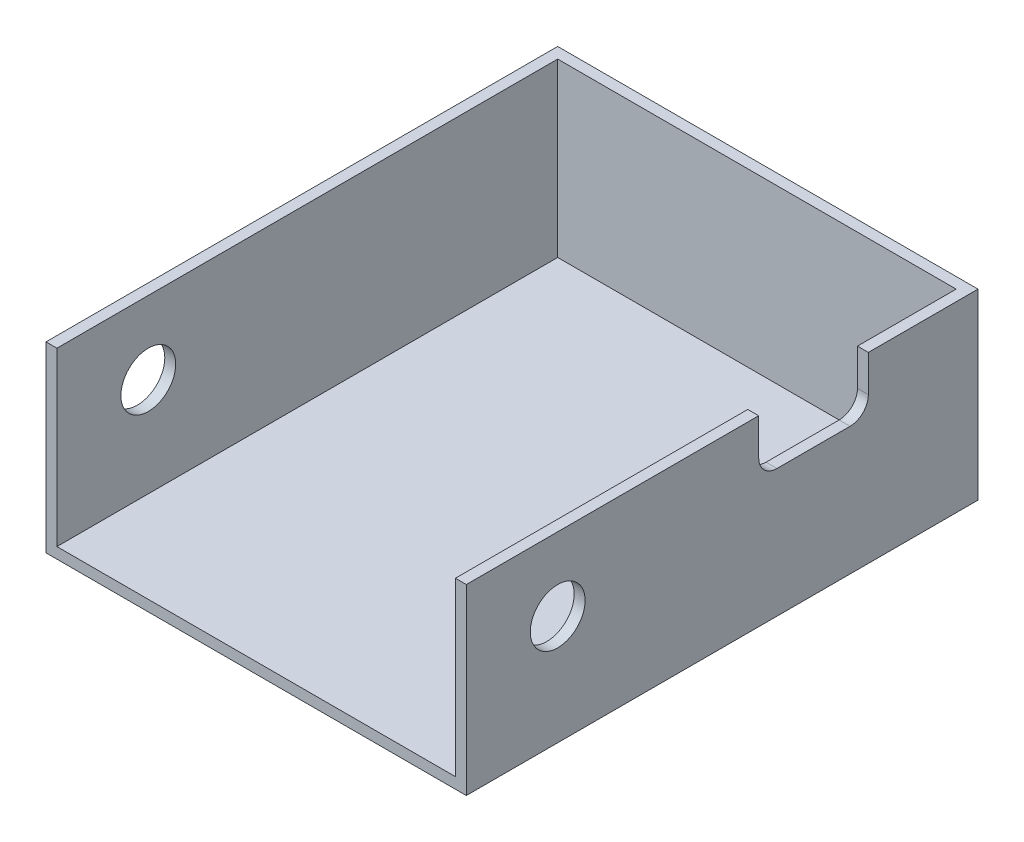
ISO-10303-21;
HEADER;
FILE_DESCRIPTION(('STEP AP214'),'2;1');
FILE_NAME('part.step','',(''),(''),'','','');
FILE_SCHEMA(('AUTOMOTIVE_DESIGN { 1 0 10303 214 1 1 1 1 }'));
ENDSEC;
DATA;
#1=APPLICATION_CONTEXT('core data for automotive mechanical design processes');
#2=APPLICATION_PROTOCOL_DEFINITION('international standard','automotive_design',2000,#1);
#3=PRODUCT_CONTEXT('',#1,'mechanical');
#4=PRODUCT('Part','Part','',(#3));
#5=PRODUCT_RELATED_PRODUCT_CATEGORY('part','',(#4));
#6=PRODUCT_DEFINITION_FORMATION('','',#4);
#7=PRODUCT_DEFINITION_CONTEXT('part definition',#1,'design');
#8=PRODUCT_DEFINITION('design','',#6,#7);
#9=PRODUCT_DEFINITION_SHAPE('','',#8);
#10=(LENGTH_UNIT() NAMED_UNIT(*) SI_UNIT(.MILLI.,.METRE.));
#11=(NAMED_UNIT(*) PLANE_ANGLE_UNIT() SI_UNIT($,.RADIAN.));
#12=(NAMED_UNIT(*) SI_UNIT($,.STERADIAN.) SOLID_ANGLE_UNIT());
#13=UNCERTAINTY_MEASURE_WITH_UNIT(LENGTH_MEASURE(1.E-05),#10,'distance_accuracy_value','');
#14=(GEOMETRIC_REPRESENTATION_CONTEXT(3) GLOBAL_UNCERTAINTY_ASSIGNED_CONTEXT((#13)) GLOBAL_UNIT_ASSIGNED_CONTEXT((#10,
#11,#12)) REPRESENTATION_CONTEXT('',''));
#15=CARTESIAN_POINT('',(0.,0.,0.));
#16=DIRECTION('',(0.,0.,1.));
#17=DIRECTION('',(1.,0.,0.));
#18=AXIS2_PLACEMENT_3D('',#15,#16,#17);
#19=CARTESIAN_POINT('',(71.12762,31.75,38.1));
#20=DIRECTION('',(0.,0.,1.));
#21=DIRECTION('',(0.,-1.,0.));
#22=AXIS2_PLACEMENT_3D('',#19,#20,#21);
#23=PLANE('',#22);
#24=DIRECTION('',(0.,-1.,0.));
#25=VECTOR('',#24,1.);
#26=CARTESIAN_POINT('',(71.12762,16.82369,38.1000000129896));
#27=LINE('',#26,#25);
#28=CARTESIAN_POINT('',(71.12762,31.75,38.1000000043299));
#29=VERTEX_POINT('',#28);
#30=CARTESIAN_POINT('',(71.12762,25.3999999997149,38.1000000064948));
#31=VERTEX_POINT('',#30);
#32=EDGE_CURVE('E114',#29,#31,#27,.T.);
#33=ORIENTED_EDGE('',*,*,#32,.F.);
#34=DIRECTION('',(1.,0.,0.));
#35=VECTOR('',#34,1.);
#36=CARTESIAN_POINT('',(72.07631,31.75,38.1));
#37=LINE('',#36,#35);
#38=CARTESIAN_POINT('',(73.025,31.75,38.1000000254));
#39=VERTEX_POINT('',#38);
#40=EDGE_CURVE('E161',#29,#39,#37,.T.);
#41=ORIENTED_EDGE('',*,*,#40,.T.);
#42=DIRECTION('',(0.,-1.,0.));
#43=VECTOR('',#42,1.);
#44=CARTESIAN_POINT('',(73.025,15.875,38.1000000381));
#45=LINE('',#44,#43);
#46=CARTESIAN_POINT('',(73.025,25.3999999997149,38.10000001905));
#47=VERTEX_POINT('',#46);
#48=EDGE_CURVE('E160',#39,#47,#45,.T.);
#49=ORIENTED_EDGE('',*,*,#48,.T.);
#50=DIRECTION('',(-1.,0.,0.));
#51=VECTOR('',#50,1.);
#52=CARTESIAN_POINT('',(72.07631,25.3999999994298,38.1));
#53=LINE('',#52,#51);
#54=EDGE_CURVE('E133',#31,#47,#53,.F.);
#55=ORIENTED_EDGE('',*,*,#54,.F.);
#56=EDGE_LOOP('',(#33,#41,#49,#55));
#57=FACE_BOUND('',#56,.T.);
#58=ADVANCED_FACE('F15',(#57),#23,.F.);
#59=CARTESIAN_POINT('',(73.025,25.4,34.925));
#60=DIRECTION('',(-1.,0.,0.));
#61=DIRECTION('',(0.,0.,1.));
#62=AXIS2_PLACEMENT_3D('',#59,#60,#61);
#63=CYLINDRICAL_SURFACE('',#62,3.175);
#64=DIRECTION('',(-1.,0.,0.));
#65=VECTOR('',#64,1.);
#66=CARTESIAN_POINT('',(72.07631,22.225,34.925));
#67=LINE('',#66,#65);
#68=CARTESIAN_POINT('',(73.025,22.225,34.925));
#69=VERTEX_POINT('',#68);
#70=CARTESIAN_POINT('',(71.12762,22.2250000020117,34.925));
#71=VERTEX_POINT('',#70);
#72=EDGE_CURVE('E125',#69,#71,#67,.T.);
#73=ORIENTED_EDGE('',*,*,#72,.T.);
#74=CARTESIAN_POINT('',(71.12762,25.4,34.925));
#75=DIRECTION('',(-1.,0.,0.));
#76=DIRECTION('',(0.,0.,1.));
#77=AXIS2_PLACEMENT_3D('',#74,#75,#76);
#78=CIRCLE('',#77,3.175);
#79=EDGE_CURVE('E19',#31,#71,#78,.F.);
#80=ORIENTED_EDGE('',*,*,#79,.F.);
#81=ORIENTED_EDGE('',*,*,#54,.T.);
#82=CARTESIAN_POINT('',(73.025,25.4,34.925));
#83=DIRECTION('',(-1.,0.,0.));
#84=DIRECTION('',(0.,0.,1.));
#85=AXIS2_PLACEMENT_3D('',#82,#83,#84);
#86=CIRCLE('',#85,3.175);
#87=EDGE_CURVE('E128',#47,#69,#86,.F.);
#88=ORIENTED_EDGE('',*,*,#87,.T.);
#89=EDGE_LOOP('',(#73,#80,#81,#88));
#90=FACE_BOUND('',#89,.T.);
#91=ADVANCED_FACE('F126',(#90),#63,.F.);
#92=CARTESIAN_POINT('',(71.12762,22.225,34.925));
#93=DIRECTION('',(0.,-1.,0.));
#94=DIRECTION('',(0.,0.,-1.));
#95=AXIS2_PLACEMENT_3D('',#92,#93,#94);
#96=PLANE('',#95);
#97=DIRECTION('',(0.,0.,-1.));
#98=VECTOR('',#97,1.);
#99=CARTESIAN_POINT('',(71.12762,22.2250000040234,45.39869));
#100=LINE('',#99,#98);
#101=CARTESIAN_POINT('',(71.12762,22.2250000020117,22.2249999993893));
#102=VERTEX_POINT('',#101);
#103=EDGE_CURVE('E121',#71,#102,#100,.T.);
#104=ORIENTED_EDGE('',*,*,#103,.F.);
#105=ORIENTED_EDGE('',*,*,#72,.F.);
#106=DIRECTION('',(0.,0.,-1.));
#107=VECTOR('',#106,1.);
#108=CARTESIAN_POINT('',(73.025,22.225,44.45));
#109=LINE('',#108,#107);
#110=CARTESIAN_POINT('',(73.025,22.225,22.2249999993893));
#111=VERTEX_POINT('',#110);
#112=EDGE_CURVE('E191',#69,#111,#109,.T.);
#113=ORIENTED_EDGE('',*,*,#112,.T.);
#114=DIRECTION('',(-1.,0.,0.));
#115=VECTOR('',#114,1.);
#116=CARTESIAN_POINT('',(72.07631,22.225,22.2249999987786));
#117=LINE('',#116,#115);
#118=EDGE_CURVE('E132',#102,#111,#117,.F.);
#119=ORIENTED_EDGE('',*,*,#118,.F.);
#120=EDGE_LOOP('',(#104,#105,#113,#119));
#121=FACE_BOUND('',#120,.T.);
#122=ADVANCED_FACE('F135',(#121),#96,.F.);
#123=CARTESIAN_POINT('',(73.025,25.4,22.225));
#124=DIRECTION('',(-1.,0.,0.));
#125=DIRECTION('',(0.,0.,1.));
#126=AXIS2_PLACEMENT_3D('',#123,#124,#125);
#127=CYLINDRICAL_SURFACE('',#126,3.175);
#128=DIRECTION('',(-1.,0.,0.));
#129=VECTOR('',#128,1.);
#130=CARTESIAN_POINT('',(72.07631,25.4,19.05));
#131=LINE('',#130,#129);
#132=CARTESIAN_POINT('',(73.025,25.4,19.0499999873));
#133=VERTEX_POINT('',#132);
#134=CARTESIAN_POINT('',(71.12762,25.4,19.0500000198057));
#135=VERTEX_POINT('',#134);
#136=EDGE_CURVE('E144',#133,#135,#131,.T.);
#137=ORIENTED_EDGE('',*,*,#136,.T.);
#138=CARTESIAN_POINT('',(71.12762,25.4,22.225));
#139=DIRECTION('',(-1.,0.,0.));
#140=DIRECTION('',(0.,0.,1.));
#141=AXIS2_PLACEMENT_3D('',#138,#139,#140);
#142=CIRCLE('',#141,3.175);
#143=EDGE_CURVE('E137',#102,#135,#142,.F.);
#144=ORIENTED_EDGE('',*,*,#143,.F.);
#145=ORIENTED_EDGE('',*,*,#118,.T.);
#146=CARTESIAN_POINT('',(73.025,25.4,22.225));
#147=DIRECTION('',(-1.,0.,0.));
#148=DIRECTION('',(0.,0.,1.));
#149=AXIS2_PLACEMENT_3D('',#146,#147,#148);
#150=CIRCLE('',#149,3.175);
#151=EDGE_CURVE('E188',#111,#133,#150,.F.);
#152=ORIENTED_EDGE('',*,*,#151,.T.);
#153=EDGE_LOOP('',(#137,#144,#145,#152));
#154=FACE_BOUND('',#153,.T.);
#155=ADVANCED_FACE('F323',(#154),#127,.F.);
#156=CARTESIAN_POINT('',(71.12762,19.05,73.025));
#157=DIRECTION('',(1.,0.,0.));
#158=DIRECTION('',(0.,0.,-1.));
#159=AXIS2_PLACEMENT_3D('',#156,#157,#158);
#160=CYLINDRICAL_SURFACE('',#159,4.76249999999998);
#161=CARTESIAN_POINT('',(71.12762,19.05,73.025));
#162=DIRECTION('',(1.,0.,0.));
#163=DIRECTION('',(0.,0.,-1.));
#164=AXIS2_PLACEMENT_3D('',#161,#162,#163);
#165=CIRCLE('',#164,4.76249999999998);
#166=CARTESIAN_POINT('',(71.12762,19.05,68.2625));
#167=VERTEX_POINT('',#166);
#168=EDGE_CURVE('E173',#167,#167,#165,.T.);
#169=ORIENTED_EDGE('',*,*,#168,.F.);
#170=EDGE_LOOP('',(#169));
#171=FACE_BOUND('',#170,.T.);
#172=CARTESIAN_POINT('',(73.025,19.05,73.025));
#173=DIRECTION('',(1.,0.,0.));
#174=DIRECTION('',(0.,0.,-1.));
#175=AXIS2_PLACEMENT_3D('',#172,#173,#174);
#176=CIRCLE('',#175,4.76249999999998);
#177=CARTESIAN_POINT('',(73.025,19.05,68.2625));
#178=VERTEX_POINT('',#177);
#179=EDGE_CURVE('E183',#178,#178,#176,.T.);
#180=ORIENTED_EDGE('',*,*,#179,.T.);
#181=EDGE_LOOP('',(#180));
#182=FACE_BOUND('',#181,.T.);
#183=ADVANCED_FACE('F320',(#171,#182),#160,.F.);
#184=CARTESIAN_POINT('',(71.12762,25.4,19.05));
#185=DIRECTION('',(0.,0.,-1.));
#186=DIRECTION('',(0.,1.,0.));
#187=AXIS2_PLACEMENT_3D('',#184,#185,#186);
#188=PLANE('',#187);
#189=DIRECTION('',(0.,1.,0.));
#190=VECTOR('',#189,1.);
#191=CARTESIAN_POINT('',(73.025,15.875,19.0499999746));
#192=LINE('',#191,#190);
#193=CARTESIAN_POINT('',(73.025,31.75,19.0499999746));
#194=VERTEX_POINT('',#193);
#195=EDGE_CURVE('E187',#133,#194,#192,.T.);
#196=ORIENTED_EDGE('',*,*,#195,.T.);
#197=DIRECTION('',(-1.,0.,0.));
#198=VECTOR('',#197,1.);
#199=CARTESIAN_POINT('',(36.5125,31.75,19.0499999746));
#200=LINE('',#199,#198);
#201=CARTESIAN_POINT('',(71.1276199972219,31.75,19.0500000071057));
#202=VERTEX_POINT('',#201);
#203=EDGE_CURVE('E147',#194,#202,#200,.T.);
#204=ORIENTED_EDGE('',*,*,#203,.T.);
#205=DIRECTION('',(0.,1.,0.));
#206=VECTOR('',#205,1.);
#207=CARTESIAN_POINT('',(71.12762,16.82369,19.0500000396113));
#208=LINE('',#207,#206);
#209=EDGE_CURVE('E139',#135,#202,#208,.T.);
#210=ORIENTED_EDGE('',*,*,#209,.F.);
#211=ORIENTED_EDGE('',*,*,#136,.F.);
#212=EDGE_LOOP('',(#196,#204,#210,#211));
#213=FACE_BOUND('',#212,.T.);
#214=ADVANCED_FACE('F206',(#213),#188,.F.);
#215=CARTESIAN_POINT('',(71.12762,1.89738,1.89738));
#216=DIRECTION('',(-1.,0.,0.));
#217=DIRECTION('',(0.,0.,1.));
#218=AXIS2_PLACEMENT_3D('',#215,#216,#217);
#219=PLANE('',#218);
#220=ORIENTED_EDGE('',*,*,#168,.T.);
#221=EDGE_LOOP('',(#220));
#222=FACE_BOUND('',#221,.T.);
#223=DIRECTION('',(0.,1.,0.));
#224=VECTOR('',#223,1.);
#225=CARTESIAN_POINT('',(71.127619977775,15.875,88.9));
#226=LINE('',#225,#224);
#227=CARTESIAN_POINT('',(71.1276199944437,1.89738,88.9));
#228=VERTEX_POINT('',#227);
#229=CARTESIAN_POINT('',(71.1276199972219,31.75,88.9));
#230=VERTEX_POINT('',#229);
#231=EDGE_CURVE('E171',#228,#230,#226,.T.);
#232=ORIENTED_EDGE('',*,*,#231,.T.);
#233=DIRECTION('',(0.,0.,-1.));
#234=VECTOR('',#233,1.);
#235=CARTESIAN_POINT('',(71.12762,31.75,63.5));
#236=LINE('',#235,#234);
#237=EDGE_CURVE('E163',#230,#29,#236,.T.);
#238=ORIENTED_EDGE('',*,*,#237,.T.);
#239=ORIENTED_EDGE('',*,*,#32,.T.);
#240=ORIENTED_EDGE('',*,*,#79,.T.);
#241=ORIENTED_EDGE('',*,*,#103,.T.);
#242=ORIENTED_EDGE('',*,*,#143,.T.);
#243=ORIENTED_EDGE('',*,*,#209,.T.);
#244=DIRECTION('',(0.,0.,-1.));
#245=VECTOR('',#244,1.);
#246=CARTESIAN_POINT('',(71.127619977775,31.75,44.45));
#247=LINE('',#246,#245);
#248=CARTESIAN_POINT('',(71.1276199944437,31.75,1.897379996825));
#249=VERTEX_POINT('',#248);
#250=EDGE_CURVE('E175',#202,#249,#247,.T.);
#251=ORIENTED_EDGE('',*,*,#250,.T.);
#252=DIRECTION('',(0.,-1.,0.));
#253=VECTOR('',#252,1.);
#254=CARTESIAN_POINT('',(71.12762,16.82369,1.89738));
#255=LINE('',#254,#253);
#256=CARTESIAN_POINT('',(71.12762,1.89738,1.89738));
#257=VERTEX_POINT('',#256);
#258=EDGE_CURVE('E229',#249,#257,#255,.T.);
#259=ORIENTED_EDGE('',*,*,#258,.T.);
#260=DIRECTION('',(0.,0.,-1.));
#261=VECTOR('',#260,1.);
#262=CARTESIAN_POINT('',(71.12762,1.89738,45.39869));
#263=LINE('',#262,#261);
#264=EDGE_CURVE('E228',#228,#257,#263,.T.);
#265=ORIENTED_EDGE('',*,*,#264,.F.);
#266=EDGE_LOOP('',(#232,#238,#239,#240,#241,#242,#243,#251,#259,#265));
#267=FACE_BOUND('',#266,.T.);
#268=ADVANCED_FACE('F119',(#222,#267),#219,.T.);
#269=CARTESIAN_POINT('',(71.12762,31.75,88.9));
#270=DIRECTION('',(0.,-1.,0.));
#271=DIRECTION('',(0.,0.,-1.));
#272=AXIS2_PLACEMENT_3D('',#269,#270,#271);
#273=PLANE('',#272);
#274=ORIENTED_EDGE('',*,*,#237,.F.);
#275=DIRECTION('',(1.,0.,0.));
#276=VECTOR('',#275,1.);
#277=CARTESIAN_POINT('',(36.5125,31.75,88.9));
#278=LINE('',#277,#276);
#279=CARTESIAN_POINT('',(73.025,31.75,88.9));
#280=VERTEX_POINT('',#279);
#281=EDGE_CURVE('E168',#230,#280,#278,.T.);
#282=ORIENTED_EDGE('',*,*,#281,.T.);
#283=DIRECTION('',(0.,0.,-1.));
#284=VECTOR('',#283,1.);
#285=CARTESIAN_POINT('',(73.025,31.75,44.45));
#286=LINE('',#285,#284);
#287=EDGE_CURVE('E157',#280,#39,#286,.T.);
#288=ORIENTED_EDGE('',*,*,#287,.T.);
#289=ORIENTED_EDGE('',*,*,#40,.F.);
#290=EDGE_LOOP('',(#274,#282,#288,#289));
#291=FACE_BOUND('',#290,.T.);
#292=ADVANCED_FACE('F221',(#291),#273,.F.);
#293=CARTESIAN_POINT('',(73.025,0.,0.));
#294=DIRECTION('',(-1.,0.,0.));
#295=DIRECTION('',(0.,0.,1.));
#296=AXIS2_PLACEMENT_3D('',#293,#294,#295);
#297=PLANE('',#296);
#298=ORIENTED_EDGE('',*,*,#179,.F.);
#299=EDGE_LOOP('',(#298));
#300=FACE_BOUND('',#299,.T.);
#301=ORIENTED_EDGE('',*,*,#151,.F.);
#302=ORIENTED_EDGE('',*,*,#112,.F.);
#303=ORIENTED_EDGE('',*,*,#87,.F.);
#304=ORIENTED_EDGE('',*,*,#48,.F.);
#305=ORIENTED_EDGE('',*,*,#287,.F.);
#306=DIRECTION('',(0.,-1.,0.));
#307=VECTOR('',#306,1.);
#308=CARTESIAN_POINT('',(73.025,15.875,88.9));
#309=LINE('',#308,#307);
#310=CARTESIAN_POINT('',(73.025,0.,88.9));
#311=VERTEX_POINT('',#310);
#312=EDGE_CURVE('E164',#280,#311,#309,.T.);
#313=ORIENTED_EDGE('',*,*,#312,.T.);
#314=DIRECTION('',(0.,0.,-1.));
#315=VECTOR('',#314,1.);
#316=CARTESIAN_POINT('',(73.025,0.,44.45));
#317=LINE('',#316,#315);
#318=CARTESIAN_POINT('',(73.025,0.,0.));
#319=VERTEX_POINT('',#318);
#320=EDGE_CURVE('E186',#311,#319,#317,.T.);
#321=ORIENTED_EDGE('',*,*,#320,.T.);
#322=DIRECTION('',(0.,-1.,0.));
#323=VECTOR('',#322,1.);
#324=CARTESIAN_POINT('',(73.025,15.875,0.));
#325=LINE('',#324,#323);
#326=CARTESIAN_POINT('',(73.025,31.75,0.));
#327=VERTEX_POINT('',#326);
#328=EDGE_CURVE('E236',#327,#319,#325,.T.);
#329=ORIENTED_EDGE('',*,*,#328,.F.);
#330=DIRECTION('',(0.,0.,1.));
#331=VECTOR('',#330,1.);
#332=CARTESIAN_POINT('',(73.025,31.75,44.45));
#333=LINE('',#332,#331);
#334=EDGE_CURVE('E151',#327,#194,#333,.T.);
#335=ORIENTED_EDGE('',*,*,#334,.T.);
#336=ORIENTED_EDGE('',*,*,#195,.F.);
#337=EDGE_LOOP('',(#301,#302,#303,#304,#305,#313,#321,#329,#335,#336));
#338=FACE_BOUND('',#337,.T.);
#339=ADVANCED_FACE('F218',(#300,#338),#297,.F.);
#340=CARTESIAN_POINT('',(0.,0.,0.));
#341=DIRECTION('',(0.,1.,0.));
#342=DIRECTION('',(0.,0.,1.));
#343=AXIS2_PLACEMENT_3D('',#340,#341,#342);
#344=PLANE('',#343);
#345=DIRECTION('',(-1.,0.,0.));
#346=VECTOR('',#345,1.);
#347=CARTESIAN_POINT('',(36.5125,0.,88.9));
#348=LINE('',#347,#346);
#349=CARTESIAN_POINT('',(0.,0.,88.9));
#350=VERTEX_POINT('',#349);
#351=EDGE_CURVE('E167',#311,#350,#348,.T.);
#352=ORIENTED_EDGE('',*,*,#351,.T.);
#353=DIRECTION('',(0.,0.,-1.));
#354=VECTOR('',#353,1.);
#355=CARTESIAN_POINT('',(0.,0.,44.45));
#356=LINE('',#355,#354);
#357=CARTESIAN_POINT('',(0.,0.,0.));
#358=VERTEX_POINT('',#357);
#359=EDGE_CURVE('E247',#350,#358,#356,.T.);
#360=ORIENTED_EDGE('',*,*,#359,.T.);
#361=DIRECTION('',(-1.,0.,0.));
#362=VECTOR('',#361,1.);
#363=CARTESIAN_POINT('',(36.5125,0.,0.));
#364=LINE('',#363,#362);
#365=EDGE_CURVE('E233',#319,#358,#364,.T.);
#366=ORIENTED_EDGE('',*,*,#365,.F.);
#367=ORIENTED_EDGE('',*,*,#320,.F.);
#368=EDGE_LOOP('',(#352,#360,#366,#367));
#369=FACE_BOUND('',#368,.T.);
#370=ADVANCED_FACE('F246',(#369),#344,.F.);
#371=CARTESIAN_POINT('',(73.025,0.,0.));
#372=DIRECTION('',(0.,0.,-1.));
#373=DIRECTION('',(-1.,0.,0.));
#374=AXIS2_PLACEMENT_3D('',#371,#372,#373);
#375=PLANE('',#374);
#376=DIRECTION('',(0.,1.,0.));
#377=VECTOR('',#376,1.);
#378=CARTESIAN_POINT('',(0.,15.875,0.));
#379=LINE('',#378,#377);
#380=CARTESIAN_POINT('',(0.,31.75,0.));
#381=VERTEX_POINT('',#380);
#382=EDGE_CURVE('E251',#358,#381,#379,.T.);
#383=ORIENTED_EDGE('',*,*,#382,.T.);
#384=DIRECTION('',(1.,0.,0.));
#385=VECTOR('',#384,1.);
#386=CARTESIAN_POINT('',(36.5125,31.75,0.));
#387=LINE('',#386,#385);
#388=EDGE_CURVE('E154',#381,#327,#387,.T.);
#389=ORIENTED_EDGE('',*,*,#388,.T.);
#390=ORIENTED_EDGE('',*,*,#328,.T.);
#391=ORIENTED_EDGE('',*,*,#365,.T.);
#392=EDGE_LOOP('',(#383,#389,#390,#391));
#393=FACE_BOUND('',#392,.T.);
#394=ADVANCED_FACE('F250',(#393),#375,.T.);
#395=CARTESIAN_POINT('',(1.89738,1.89738,1.89738));
#396=DIRECTION('',(0.,1.,0.));
#397=DIRECTION('',(0.,0.,1.));
#398=AXIS2_PLACEMENT_3D('',#395,#396,#397);
#399=PLANE('',#398);
#400=DIRECTION('',(-1.,0.,0.));
#401=VECTOR('',#400,1.);
#402=CARTESIAN_POINT('',(36.5125,1.89738,1.89738));
#403=LINE('',#402,#401);
#404=CARTESIAN_POINT('',(1.89738,1.89738,1.89737999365));
#405=VERTEX_POINT('',#404);
#406=EDGE_CURVE('E178',#257,#405,#403,.T.);
#407=ORIENTED_EDGE('',*,*,#406,.T.);
#408=DIRECTION('',(0.,0.,-1.));
#409=VECTOR('',#408,1.);
#410=CARTESIAN_POINT('',(1.89738,1.89738,45.3986899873));
#411=LINE('',#410,#409);
#412=CARTESIAN_POINT('',(1.89738000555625,1.89738,88.9));
#413=VERTEX_POINT('',#412);
#414=EDGE_CURVE('E272',#413,#405,#411,.T.);
#415=ORIENTED_EDGE('',*,*,#414,.F.);
#416=DIRECTION('',(1.,0.,0.));
#417=VECTOR('',#416,1.);
#418=CARTESIAN_POINT('',(36.5125,1.89738,88.9));
#419=LINE('',#418,#417);
#420=EDGE_CURVE('E150',#413,#228,#419,.T.);
#421=ORIENTED_EDGE('',*,*,#420,.T.);
#422=ORIENTED_EDGE('',*,*,#264,.T.);
#423=EDGE_LOOP('',(#407,#415,#421,#422));
#424=FACE_BOUND('',#423,.T.);
#425=ADVANCED_FACE('F271',(#424),#399,.T.);
#426=CARTESIAN_POINT('',(71.12762,1.89738,1.89738));
#427=DIRECTION('',(0.,0.,-1.));
#428=DIRECTION('',(-1.,0.,0.));
#429=AXIS2_PLACEMENT_3D('',#426,#427,#428);
#430=PLANE('',#429);
#431=ORIENTED_EDGE('',*,*,#258,.F.);
#432=DIRECTION('',(-1.,0.,0.));
#433=VECTOR('',#432,1.);
#434=CARTESIAN_POINT('',(36.5125,31.75,1.8973799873));
#435=LINE('',#434,#433);
#436=CARTESIAN_POINT('',(1.89738000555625,31.75,1.897379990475));
#437=VERTEX_POINT('',#436);
#438=EDGE_CURVE('E177',#249,#437,#435,.T.);
#439=ORIENTED_EDGE('',*,*,#438,.T.);
#440=DIRECTION('',(0.,1.,0.));
#441=VECTOR('',#440,1.);
#442=CARTESIAN_POINT('',(1.89738,16.82369,1.8973799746));
#443=LINE('',#442,#441);
#444=EDGE_CURVE('E274',#405,#437,#443,.T.);
#445=ORIENTED_EDGE('',*,*,#444,.F.);
#446=ORIENTED_EDGE('',*,*,#406,.F.);
#447=EDGE_LOOP('',(#431,#439,#445,#446));
#448=FACE_BOUND('',#447,.T.);
#449=ADVANCED_FACE('F275',(#448),#430,.F.);
#450=CARTESIAN_POINT('',(0.,31.75,88.9));
#451=DIRECTION('',(0.,-1.,0.));
#452=DIRECTION('',(0.,0.,-1.));
#453=AXIS2_PLACEMENT_3D('',#450,#451,#452);
#454=PLANE('',#453);
#455=ORIENTED_EDGE('',*,*,#334,.F.);
#456=ORIENTED_EDGE('',*,*,#388,.F.);
#457=DIRECTION('',(0.,0.,1.));
#458=VECTOR('',#457,1.);
#459=CARTESIAN_POINT('',(0.,31.75,44.45));
#460=LINE('',#459,#458);
#461=CARTESIAN_POINT('',(0.,31.75,88.9));
#462=VERTEX_POINT('',#461);
#463=EDGE_CURVE('E257',#381,#462,#460,.T.);
#464=ORIENTED_EDGE('',*,*,#463,.T.);
#465=DIRECTION('',(1.,0.,0.));
#466=VECTOR('',#465,1.);
#467=CARTESIAN_POINT('',(36.5125,31.75,88.9));
#468=LINE('',#467,#466);
#469=CARTESIAN_POINT('',(1.89738001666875,31.75,88.9));
#470=VERTEX_POINT('',#469);
#471=EDGE_CURVE('E261',#462,#470,#468,.T.);
#472=ORIENTED_EDGE('',*,*,#471,.T.);
#473=DIRECTION('',(0.,0.,1.));
#474=VECTOR('',#473,1.);
#475=CARTESIAN_POINT('',(1.89738,31.75,45.3986899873));
#476=LINE('',#475,#474);
#477=EDGE_CURVE('E34',#437,#470,#476,.T.);
#478=ORIENTED_EDGE('',*,*,#477,.F.);
#479=ORIENTED_EDGE('',*,*,#438,.F.);
#480=ORIENTED_EDGE('',*,*,#250,.F.);
#481=ORIENTED_EDGE('',*,*,#203,.F.);
#482=EDGE_LOOP('',(#455,#456,#464,#472,#478,#479,#480,#481));
#483=FACE_BOUND('',#482,.T.);
#484=ADVANCED_FACE('F204',(#483),#454,.F.);
#485=CARTESIAN_POINT('',(73.025,0.,88.9));
#486=DIRECTION('',(0.,0.,-1.));
#487=DIRECTION('',(-1.,0.,0.));
#488=AXIS2_PLACEMENT_3D('',#485,#486,#487);
#489=PLANE('',#488);
#490=ORIENTED_EDGE('',*,*,#471,.F.);
#491=DIRECTION('',(0.,-1.,0.));
#492=VECTOR('',#491,1.);
#493=CARTESIAN_POINT('',(0.,15.875,88.9));
#494=LINE('',#493,#492);
#495=EDGE_CURVE('E259',#462,#350,#494,.T.);
#496=ORIENTED_EDGE('',*,*,#495,.T.);
#497=ORIENTED_EDGE('',*,*,#351,.F.);
#498=ORIENTED_EDGE('',*,*,#312,.F.);
#499=ORIENTED_EDGE('',*,*,#281,.F.);
#500=ORIENTED_EDGE('',*,*,#231,.F.);
#501=ORIENTED_EDGE('',*,*,#420,.F.);
#502=DIRECTION('',(0.,-1.,0.));
#503=VECTOR('',#502,1.);
#504=CARTESIAN_POINT('',(1.89738,16.82369,88.9));
#505=LINE('',#504,#503);
#506=EDGE_CURVE('E182',#470,#413,#505,.T.);
#507=ORIENTED_EDGE('',*,*,#506,.F.);
#508=EDGE_LOOP('',(#490,#496,#497,#498,#499,#500,#501,#507));
#509=FACE_BOUND('',#508,.T.);
#510=ADVANCED_FACE('F225',(#509),#489,.F.);
#511=CARTESIAN_POINT('',(0.,0.,88.9));
#512=DIRECTION('',(1.,0.,0.));
#513=DIRECTION('',(0.,0.,-1.));
#514=AXIS2_PLACEMENT_3D('',#511,#512,#513);
#515=PLANE('',#514);
#516=CARTESIAN_POINT('',(0.,19.05,73.025));
#517=DIRECTION('',(1.,0.,0.));
#518=DIRECTION('',(0.,0.,-1.));
#519=AXIS2_PLACEMENT_3D('',#516,#517,#518);
#520=CIRCLE('',#519,4.76249999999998);
#521=CARTESIAN_POINT('',(0.,19.05,68.2625));
#522=VERTEX_POINT('',#521);
#523=EDGE_CURVE('E25',#522,#522,#520,.F.);
#524=ORIENTED_EDGE('',*,*,#523,.F.);
#525=EDGE_LOOP('',(#524));
#526=FACE_BOUND('',#525,.T.);
#527=ORIENTED_EDGE('',*,*,#463,.F.);
#528=ORIENTED_EDGE('',*,*,#382,.F.);
#529=ORIENTED_EDGE('',*,*,#359,.F.);
#530=ORIENTED_EDGE('',*,*,#495,.F.);
#531=EDGE_LOOP('',(#527,#528,#529,#530));
#532=FACE_BOUND('',#531,.T.);
#533=ADVANCED_FACE('F254',(#526,#532),#515,.F.);
#534=CARTESIAN_POINT('',(1.89738,1.89738,88.9));
#535=DIRECTION('',(1.,0.,0.));
#536=DIRECTION('',(0.,0.,-1.));
#537=AXIS2_PLACEMENT_3D('',#534,#535,#536);
#538=PLANE('',#537);
#539=CARTESIAN_POINT('',(1.89738,19.05,73.025));
#540=DIRECTION('',(1.,0.,0.));
#541=DIRECTION('',(0.,0.,-1.));
#542=AXIS2_PLACEMENT_3D('',#539,#540,#541);
#543=CIRCLE('',#542,4.76249999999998);
#544=CARTESIAN_POINT('',(1.89738,19.05,68.2625));
#545=VERTEX_POINT('',#544);
#546=EDGE_CURVE('E10',#545,#545,#543,.T.);
#547=ORIENTED_EDGE('',*,*,#546,.F.);
#548=EDGE_LOOP('',(#547));
#549=FACE_BOUND('',#548,.T.);
#550=ORIENTED_EDGE('',*,*,#477,.T.);
#551=ORIENTED_EDGE('',*,*,#506,.T.);
#552=ORIENTED_EDGE('',*,*,#414,.T.);
#553=ORIENTED_EDGE('',*,*,#444,.T.);
#554=EDGE_LOOP('',(#550,#551,#552,#553));
#555=FACE_BOUND('',#554,.T.);
#556=ADVANCED_FACE('F17',(#549,#555),#538,.T.);
#557=CARTESIAN_POINT('',(0.,19.05,73.025));
#558=DIRECTION('',(1.,0.,0.));
#559=DIRECTION('',(0.,0.,-1.));
#560=AXIS2_PLACEMENT_3D('',#557,#558,#559);
#561=CYLINDRICAL_SURFACE('',#560,4.76249999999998);
#562=ORIENTED_EDGE('',*,*,#546,.T.);
#563=EDGE_LOOP('',(#562));
#564=FACE_BOUND('',#563,.T.);
#565=ORIENTED_EDGE('',*,*,#523,.T.);
#566=EDGE_LOOP('',(#565));
#567=FACE_BOUND('',#566,.T.);
#568=ADVANCED_FACE('F283',(#564,#567),#561,.F.);
#569=CLOSED_SHELL('',(#58,#91,#122,#155,#183,#214,#268,#292,#339,#370,#394,#425,#449,#484,#510,
#533,#556,#568));
#570=MANIFOLD_SOLID_BREP('B1',#569);
#571=ADVANCED_BREP_SHAPE_REPRESENTATION('',(#18,#570),#14);
#572=SHAPE_DEFINITION_REPRESENTATION(#9,#571);
ENDSEC;
END-ISO-10303-21;
